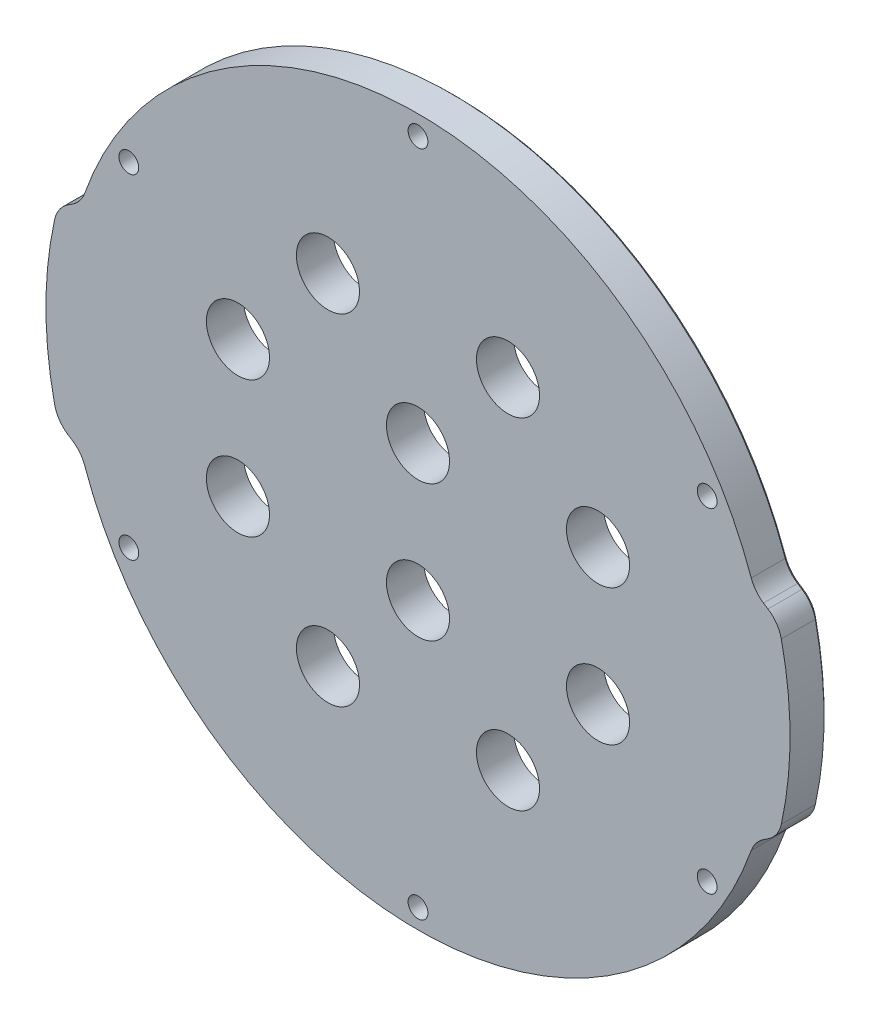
from build123d import *

# Parameters (mm, degrees)
SKETCH1_R           = 1.6
BOSS_EXTRUDE1_DEPTH = 6
SKETCH6_R           = 5.1
CUT_EXTRUDE2_DEPTH  = 84.187408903
FILLET1_R           = 5
CHAMFER1_SIZE       = 0.5


with BuildPart() as part:
    # Sketch1 → Boss-Extrude1 (new body)
    with BuildSketch(Plane.XY):
        with BuildLine():
            Line((54.404710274, 17.5), (58.249656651, 15))
            ThreePointArc((58.249656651, 15), (60.15, 0), (58.249656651, -15))
            Line((58.249656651, -15), (54.404710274, -17.5))
            ThreePointArc((54.404710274, -17.5), (0, -57.15), (-54.404710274, -17.5))
            Line((-54.404710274, -17.5), (-58.249656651, -15))
            ThreePointArc((-58.249656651, -15), (-60.15, 0), (-58.249656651, 15))
            Line((-58.249656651, 15), (-54.404710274, 17.5))
            ThreePointArc((-54.404710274, 17.5), (0, 57.15), (54.404710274, 17.5))
        make_face()
        with Locations((0, 53.975)):
            Circle(SKETCH1_R, mode=Mode.SUBTRACT)
        with Locations((46.743721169, 26.9875)):
            Circle(SKETCH1_R, mode=Mode.SUBTRACT)
        with Locations((46.743721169, -26.9875)):
            Circle(SKETCH1_R, mode=Mode.SUBTRACT)
        with Locations((0, -53.975)):
            Circle(SKETCH1_R, mode=Mode.SUBTRACT)
        with Locations((-46.743721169, -26.9875)):
            Circle(SKETCH1_R, mode=Mode.SUBTRACT)
        with Locations((-46.743721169, 26.9875)):
            Circle(SKETCH1_R, mode=Mode.SUBTRACT)
    extrude(amount=BOSS_EXTRUDE1_DEPTH)

    # Sketch6 → Cut-Extrude2 (cut, through all)
    with BuildSketch(Plane(origin=(0, 0, 0), x_dir=(-1, 0, 0), z_dir=(0, 0, -1))):
        with Locations((14.551632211, 27.5)):
            Circle(SKETCH6_R)
        with Locations((-29.103264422, 11)):
            Circle(SKETCH6_R)
        with Locations((-29.103264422, -11)):
            Circle(SKETCH6_R)
        with Locations((29.103264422, -11)):
            Circle(SKETCH6_R)
        with Locations((29.103264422, 11)):
            Circle(SKETCH6_R)
        with Locations((-14.551632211, 27.5)):
            Circle(SKETCH6_R)
        with Locations((0, -11)):
            Circle(SKETCH6_R)
        with Locations((-14.551632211, -27.5)):
            Circle(SKETCH6_R)
        with Locations((0, 11)):
            Circle(SKETCH6_R)
        with Locations((14.551632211, -27.5)):
            Circle(SKETCH6_R)
    extrude(amount=-CUT_EXTRUDE2_DEPTH, mode=Mode.SUBTRACT)

    # Fillet1
    fillet1_edges = [part.edges().sort_by_distance(p)[0] for p in [
        (54.404710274, 17.5, 3),
        (58.249656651, 15, 3),
        (58.249656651, -15, 3),
        (54.404710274, -17.5, 3),
        (-54.404710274, -17.5, 3),
        (-58.249656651, -15, 3),
        (-58.249656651, 15, 3),
        (-54.404710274, 17.5, 3),
    ]]
    fillet(fillet1_edges, radius=FILLET1_R)

    # Chamfer1
    chamfer1_edges = [part.edges().sort_by_distance(p)[0] for p in [
        (54.657828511, -17.651398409, 0),
        (54.657828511, 17.651398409, 0),
        (-54.657828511, -17.651398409, 0),
        (-54.657828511, 17.651398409, 0),
        (60.15, 0, 0),
        (0, 57.15, 0),
        (56.218559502, 16.320627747, 0),
        (56.218559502, -16.320627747, 0),
        (0, -57.15, 0),
        (-56.218559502, -16.320627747, 0),
        (-60.15, 0, 0),
        (-56.218559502, 16.320627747, 0),
        (-57.961950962, 14.742761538, 0),
        (-57.961950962, -14.742761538, 0),
        (57.961950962, 14.742761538, 0),
        (57.961950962, -14.742761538, 0),
    ]]
    chamfer(chamfer1_edges, length=CHAMFER1_SIZE)


solid = part.part
